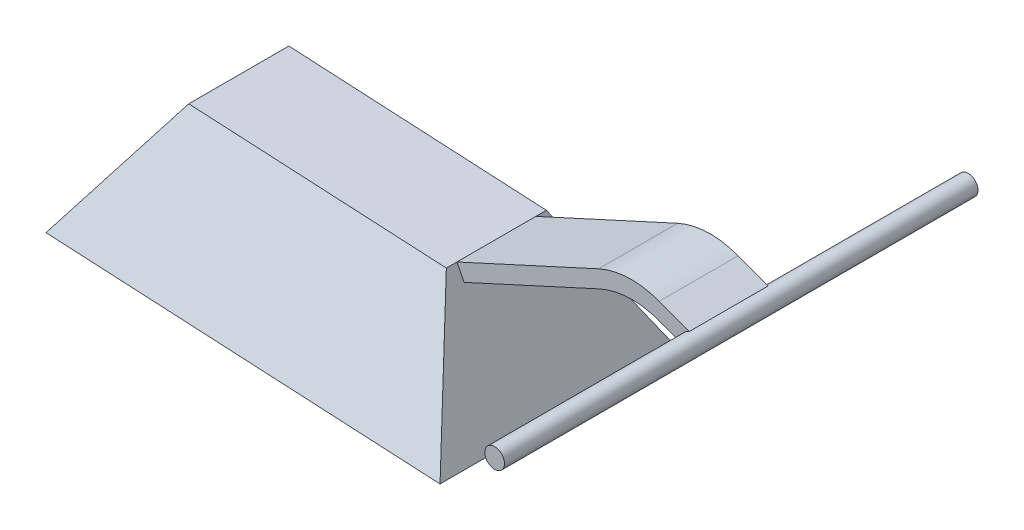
ISO-10303-21;
HEADER;
FILE_DESCRIPTION(('STEP AP214'),'2;1');
FILE_NAME('part.step','',(''),(''),'','','');
FILE_SCHEMA(('AUTOMOTIVE_DESIGN { 1 0 10303 214 1 1 1 1 }'));
ENDSEC;
DATA;
#1=APPLICATION_CONTEXT('core data for automotive mechanical design processes');
#2=APPLICATION_PROTOCOL_DEFINITION('international standard','automotive_design',2000,#1);
#3=PRODUCT_CONTEXT('',#1,'mechanical');
#4=PRODUCT('Part','Part','',(#3));
#5=PRODUCT_RELATED_PRODUCT_CATEGORY('part','',(#4));
#6=PRODUCT_DEFINITION_FORMATION('','',#4);
#7=PRODUCT_DEFINITION_CONTEXT('part definition',#1,'design');
#8=PRODUCT_DEFINITION('design','',#6,#7);
#9=PRODUCT_DEFINITION_SHAPE('','',#8);
#10=(LENGTH_UNIT() NAMED_UNIT(*) SI_UNIT(.MILLI.,.METRE.));
#11=(NAMED_UNIT(*) PLANE_ANGLE_UNIT() SI_UNIT($,.RADIAN.));
#12=(NAMED_UNIT(*) SI_UNIT($,.STERADIAN.) SOLID_ANGLE_UNIT());
#13=UNCERTAINTY_MEASURE_WITH_UNIT(LENGTH_MEASURE(1.E-05),#10,'distance_accuracy_value','');
#14=(GEOMETRIC_REPRESENTATION_CONTEXT(3) GLOBAL_UNCERTAINTY_ASSIGNED_CONTEXT((#13)) GLOBAL_UNIT_ASSIGNED_CONTEXT((#10,
#11,#12)) REPRESENTATION_CONTEXT('',''));
#15=CARTESIAN_POINT('',(0.,0.,0.));
#16=DIRECTION('',(0.,0.,1.));
#17=DIRECTION('',(1.,0.,0.));
#18=AXIS2_PLACEMENT_3D('',#15,#16,#17);
#19=CARTESIAN_POINT('',(47.,22.25,30.));
#20=DIRECTION('',(0.,0.,-1.));
#21=DIRECTION('',(-1.,0.,0.));
#22=AXIS2_PLACEMENT_3D('',#19,#20,#21);
#23=CYLINDRICAL_SURFACE('',#22,1.25);
#24=CARTESIAN_POINT('',(47.,22.25,-30.));
#25=DIRECTION('',(0.,0.,1.));
#26=DIRECTION('',(1.,0.,0.));
#27=AXIS2_PLACEMENT_3D('',#24,#25,#26);
#28=CIRCLE('',#27,1.25);
#29=CARTESIAN_POINT('',(48.25,22.25,-30.));
#30=VERTEX_POINT('',#29);
#31=EDGE_CURVE('E124',#30,#30,#28,.T.);
#32=ORIENTED_EDGE('',*,*,#31,.T.);
#33=EDGE_LOOP('',(#32));
#34=FACE_BOUND('',#33,.T.);
#35=CARTESIAN_POINT('',(47.,22.25,30.));
#36=DIRECTION('',(0.,0.,1.));
#37=DIRECTION('',(1.,0.,0.));
#38=AXIS2_PLACEMENT_3D('',#35,#36,#37);
#39=CIRCLE('',#38,1.25);
#40=CARTESIAN_POINT('',(48.25,22.25,30.));
#41=VERTEX_POINT('',#40);
#42=EDGE_CURVE('E155',#41,#41,#39,.T.);
#43=ORIENTED_EDGE('',*,*,#42,.F.);
#44=EDGE_LOOP('',(#43));
#45=FACE_BOUND('',#44,.T.);
#46=CARTESIAN_POINT('',(47.,22.25,5.));
#47=DIRECTION('',(0.,0.,-1.));
#48=DIRECTION('',(-1.,0.,0.));
#49=AXIS2_PLACEMENT_3D('',#46,#47,#48);
#50=CIRCLE('',#49,1.25);
#51=CARTESIAN_POINT('',(45.9466296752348,21.5770134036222,5.));
#52=VERTEX_POINT('',#51);
#53=CARTESIAN_POINT('',(46.6488765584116,23.4496717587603,5.));
#54=VERTEX_POINT('',#53);
#55=EDGE_CURVE('E169',#52,#54,#50,.T.);
#56=ORIENTED_EDGE('',*,*,#55,.F.);
#57=DIRECTION('',(0.,0.,-1.));
#58=VECTOR('',#57,1.);
#59=CARTESIAN_POINT('',(45.9466296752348,21.5770134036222,30.));
#60=LINE('',#59,#58);
#61=CARTESIAN_POINT('',(45.9466296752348,21.5770134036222,-5.));
#62=VERTEX_POINT('',#61);
#63=EDGE_CURVE('E166',#62,#52,#60,.F.);
#64=ORIENTED_EDGE('',*,*,#63,.F.);
#65=CARTESIAN_POINT('',(47.,22.25,-5.));
#66=DIRECTION('',(0.,0.,-1.));
#67=DIRECTION('',(-1.,0.,0.));
#68=AXIS2_PLACEMENT_3D('',#65,#66,#67);
#69=CIRCLE('',#68,1.25);
#70=CARTESIAN_POINT('',(46.6488765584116,23.4496717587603,-5.));
#71=VERTEX_POINT('',#70);
#72=EDGE_CURVE('E158',#62,#71,#69,.T.);
#73=ORIENTED_EDGE('',*,*,#72,.T.);
#74=DIRECTION('',(0.,0.,-1.));
#75=VECTOR('',#74,1.);
#76=CARTESIAN_POINT('',(46.6488765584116,23.4496717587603,30.));
#77=LINE('',#76,#75);
#78=EDGE_CURVE('E163',#71,#54,#77,.F.);
#79=ORIENTED_EDGE('',*,*,#78,.T.);
#80=EDGE_LOOP('',(#56,#64,#73,#79));
#81=FACE_BOUND('',#80,.T.);
#82=ADVANCED_FACE('F49',(#34,#45,#81),#23,.T.);
#83=CARTESIAN_POINT('',(47.,22.25,30.));
#84=DIRECTION('',(0.,0.,1.));
#85=DIRECTION('',(1.,0.,0.));
#86=AXIS2_PLACEMENT_3D('',#83,#84,#85);
#87=PLANE('',#86);
#88=ORIENTED_EDGE('',*,*,#42,.T.);
#89=EDGE_LOOP('',(#88));
#90=FACE_BOUND('',#89,.T.);
#91=ADVANCED_FACE('F207',(#90),#87,.T.);
#92=CARTESIAN_POINT('',(47.,22.25,-30.));
#93=DIRECTION('',(0.,0.,1.));
#94=DIRECTION('',(1.,0.,0.));
#95=AXIS2_PLACEMENT_3D('',#92,#93,#94);
#96=PLANE('',#95);
#97=ORIENTED_EDGE('',*,*,#31,.F.);
#98=EDGE_LOOP('',(#97));
#99=FACE_BOUND('',#98,.T.);
#100=ADVANCED_FACE('F215',(#99),#96,.F.);
#101=CARTESIAN_POINT('',(38.6488765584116,24.313670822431,5.));
#102=DIRECTION('',(0.351123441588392,0.936329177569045,0.));
#103=DIRECTION('',(-0.936329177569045,0.351123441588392,0.));
#104=AXIS2_PLACEMENT_3D('',#101,#102,#103);
#105=PLANE('',#104);
#106=DIRECTION('',(0.936329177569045,-0.351123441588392,0.));
#107=VECTOR('',#106,1.);
#108=CARTESIAN_POINT('',(38.6488765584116,24.313670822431,5.));
#109=LINE('',#108,#107);
#110=CARTESIAN_POINT('',(42.9331010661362,22.7070866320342,5.));
#111=VERTEX_POINT('',#110);
#112=EDGE_CURVE('E153',#111,#52,#109,.T.);
#113=ORIENTED_EDGE('',*,*,#112,.F.);
#114=DIRECTION('',(0.,0.,-1.));
#115=VECTOR('',#114,1.);
#116=CARTESIAN_POINT('',(42.9331010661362,22.7070866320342,-5.));
#117=LINE('',#116,#115);
#118=CARTESIAN_POINT('',(42.9331010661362,22.7070866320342,-5.));
#119=VERTEX_POINT('',#118);
#120=EDGE_CURVE('E172',#111,#119,#117,.T.);
#121=ORIENTED_EDGE('',*,*,#120,.T.);
#122=DIRECTION('',(0.936329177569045,-0.351123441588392,0.));
#123=VECTOR('',#122,1.);
#124=CARTESIAN_POINT('',(38.6488765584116,24.313670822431,-5.));
#125=LINE('',#124,#123);
#126=EDGE_CURVE('E143',#119,#62,#125,.T.);
#127=ORIENTED_EDGE('',*,*,#126,.T.);
#128=ORIENTED_EDGE('',*,*,#63,.T.);
#129=EDGE_LOOP('',(#113,#121,#127,#128));
#130=FACE_BOUND('',#129,.T.);
#131=ADVANCED_FACE('F194',(#130),#105,.F.);
#132=CARTESIAN_POINT('',(39.3511234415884,26.186329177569,5.));
#133=DIRECTION('',(0.351123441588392,0.936329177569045,0.));
#134=DIRECTION('',(-0.936329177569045,0.351123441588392,0.));
#135=AXIS2_PLACEMENT_3D('',#132,#133,#134);
#136=PLANE('',#135);
#137=DIRECTION('',(0.936329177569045,-0.351123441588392,0.));
#138=VECTOR('',#137,1.);
#139=CARTESIAN_POINT('',(39.3511234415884,26.186329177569,-5.));
#140=LINE('',#139,#138);
#141=CARTESIAN_POINT('',(42.8563980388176,24.8718512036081,-5.));
#142=VERTEX_POINT('',#141);
#143=EDGE_CURVE('E145',#142,#71,#140,.T.);
#144=ORIENTED_EDGE('',*,*,#143,.F.);
#145=DIRECTION('',(0.,0.,-1.));
#146=VECTOR('',#145,1.);
#147=CARTESIAN_POINT('',(42.8563980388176,24.8718512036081,5.));
#148=LINE('',#147,#146);
#149=CARTESIAN_POINT('',(42.8563980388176,24.8718512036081,5.));
#150=VERTEX_POINT('',#149);
#151=EDGE_CURVE('E64',#142,#150,#148,.F.);
#152=ORIENTED_EDGE('',*,*,#151,.T.);
#153=DIRECTION('',(0.936329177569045,-0.351123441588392,0.));
#154=VECTOR('',#153,1.);
#155=CARTESIAN_POINT('',(39.3511234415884,26.186329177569,5.));
#156=LINE('',#155,#154);
#157=EDGE_CURVE('E134',#150,#54,#156,.T.);
#158=ORIENTED_EDGE('',*,*,#157,.T.);
#159=ORIENTED_EDGE('',*,*,#78,.F.);
#160=EDGE_LOOP('',(#144,#152,#158,#159));
#161=FACE_BOUND('',#160,.T.);
#162=ADVANCED_FACE('F199',(#161),#136,.T.);
#163=CARTESIAN_POINT('',(15.6933827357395,15.6721591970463,5.));
#164=DIRECTION('',(-0.416512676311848,0.909129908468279,0.));
#165=DIRECTION('',(-0.909129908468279,-0.416512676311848,0.));
#166=AXIS2_PLACEMENT_3D('',#163,#164,#165);
#167=PLANE('',#166);
#168=DIRECTION('',(0.909129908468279,0.416512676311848,0.));
#169=VECTOR('',#168,1.);
#170=CARTESIAN_POINT('',(15.6933827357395,15.6721591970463,5.));
#171=LINE('',#170,#169);
#172=CARTESIAN_POINT('',(15.6933827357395,15.6721591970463,5.));
#173=VERTEX_POINT('',#172);
#174=CARTESIAN_POINT('',(35.1800368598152,24.5998585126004,5.));
#175=VERTEX_POINT('',#174);
#176=EDGE_CURVE('E117',#173,#175,#171,.T.);
#177=ORIENTED_EDGE('',*,*,#176,.T.);
#178=DIRECTION('',(0.,0.,-1.));
#179=VECTOR('',#178,1.);
#180=CARTESIAN_POINT('',(35.1800368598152,24.5998585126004,5.));
#181=LINE('',#180,#179);
#182=CARTESIAN_POINT('',(35.1800368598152,24.5998585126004,-5.));
#183=VERTEX_POINT('',#182);
#184=EDGE_CURVE('E177',#175,#183,#181,.T.);
#185=ORIENTED_EDGE('',*,*,#184,.T.);
#186=DIRECTION('',(0.909129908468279,0.416512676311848,0.));
#187=VECTOR('',#186,1.);
#188=CARTESIAN_POINT('',(15.6933827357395,15.6721591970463,-5.));
#189=LINE('',#188,#187);
#190=CARTESIAN_POINT('',(15.6933827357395,15.6721591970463,-5.));
#191=VERTEX_POINT('',#190);
#192=EDGE_CURVE('E119',#191,#183,#189,.T.);
#193=ORIENTED_EDGE('',*,*,#192,.F.);
#194=DIRECTION('',(0.,0.,-1.));
#195=VECTOR('',#194,1.);
#196=CARTESIAN_POINT('',(15.6933827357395,15.6721591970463,5.));
#197=LINE('',#196,#195);
#198=EDGE_CURVE('E113',#173,#191,#197,.T.);
#199=ORIENTED_EDGE('',*,*,#198,.F.);
#200=EDGE_LOOP('',(#177,#185,#193,#199));
#201=FACE_BOUND('',#200,.T.);
#202=ADVANCED_FACE('F115',(#201),#167,.T.);
#203=CARTESIAN_POINT('',(16.5264080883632,13.8538993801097,5.));
#204=DIRECTION('',(-0.909129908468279,-0.416512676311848,0.));
#205=DIRECTION('',(0.416512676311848,-0.909129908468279,0.));
#206=AXIS2_PLACEMENT_3D('',#203,#204,#205);
#207=PLANE('',#206);
#208=DIRECTION('',(-0.416512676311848,0.909129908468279,0.));
#209=VECTOR('',#208,1.);
#210=CARTESIAN_POINT('',(16.5264080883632,13.8538993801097,-5.));
#211=LINE('',#210,#209);
#212=CARTESIAN_POINT('',(16.5264080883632,13.8538993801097,-5.));
#213=VERTEX_POINT('',#212);
#214=EDGE_CURVE('E148',#213,#191,#211,.T.);
#215=ORIENTED_EDGE('',*,*,#214,.F.);
#216=DIRECTION('',(0.,0.,-1.));
#217=VECTOR('',#216,1.);
#218=CARTESIAN_POINT('',(16.5264080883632,13.8538993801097,5.));
#219=LINE('',#218,#217);
#220=CARTESIAN_POINT('',(16.5264080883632,13.8538993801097,5.));
#221=VERTEX_POINT('',#220);
#222=EDGE_CURVE('E125',#221,#213,#219,.T.);
#223=ORIENTED_EDGE('',*,*,#222,.F.);
#224=DIRECTION('',(-0.416512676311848,0.909129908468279,0.));
#225=VECTOR('',#224,1.);
#226=CARTESIAN_POINT('',(16.5264080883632,13.8538993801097,5.));
#227=LINE('',#226,#225);
#228=EDGE_CURVE('E131',#221,#173,#227,.T.);
#229=ORIENTED_EDGE('',*,*,#228,.T.);
#230=ORIENTED_EDGE('',*,*,#198,.T.);
#231=EDGE_LOOP('',(#215,#223,#229,#230));
#232=FACE_BOUND('',#231,.T.);
#233=ADVANCED_FACE('F136',(#232),#207,.T.);
#234=CARTESIAN_POINT('',(16.5264080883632,13.8538993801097,5.));
#235=DIRECTION('',(-0.416512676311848,0.909129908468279,0.));
#236=DIRECTION('',(-0.909129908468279,-0.416512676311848,0.));
#237=AXIS2_PLACEMENT_3D('',#234,#235,#236);
#238=PLANE('',#237);
#239=DIRECTION('',(0.909129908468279,0.416512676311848,0.));
#240=VECTOR('',#239,1.);
#241=CARTESIAN_POINT('',(16.5264080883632,13.8538993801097,-5.));
#242=LINE('',#241,#240);
#243=CARTESIAN_POINT('',(35.2567398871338,22.4350939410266,-5.));
#244=VERTEX_POINT('',#243);
#245=EDGE_CURVE('E150',#213,#244,#242,.T.);
#246=ORIENTED_EDGE('',*,*,#245,.T.);
#247=DIRECTION('',(0.,0.,-1.));
#248=VECTOR('',#247,1.);
#249=CARTESIAN_POINT('',(35.2567398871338,22.4350939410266,5.));
#250=LINE('',#249,#248);
#251=CARTESIAN_POINT('',(35.2567398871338,22.4350939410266,5.));
#252=VERTEX_POINT('',#251);
#253=EDGE_CURVE('E175',#244,#252,#250,.F.);
#254=ORIENTED_EDGE('',*,*,#253,.T.);
#255=DIRECTION('',(0.909129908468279,0.416512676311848,0.));
#256=VECTOR('',#255,1.);
#257=CARTESIAN_POINT('',(16.5264080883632,13.8538993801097,5.));
#258=LINE('',#257,#256);
#259=EDGE_CURVE('E138',#221,#252,#258,.T.);
#260=ORIENTED_EDGE('',*,*,#259,.F.);
#261=ORIENTED_EDGE('',*,*,#222,.T.);
#262=EDGE_LOOP('',(#246,#254,#260,#261));
#263=FACE_BOUND('',#262,.T.);
#264=ADVANCED_FACE('F189',(#263),#238,.F.);
#265=CARTESIAN_POINT('',(0.,0.,5.));
#266=DIRECTION('',(0.,0.,-1.));
#267=DIRECTION('',(-1.,0.,0.));
#268=AXIS2_PLACEMENT_3D('',#265,#266,#267);
#269=PLANE('',#268);
#270=ORIENTED_EDGE('',*,*,#157,.F.);
#271=CARTESIAN_POINT('',(39.3451636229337,15.5085594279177,5.));
#272=DIRECTION('',(0.,0.,-1.));
#273=DIRECTION('',(-1.,0.,0.));
#274=AXIS2_PLACEMENT_3D('',#271,#272,#273);
#275=CIRCLE('',#274,10.);
#276=EDGE_CURVE('E133',#150,#175,#275,.F.);
#277=ORIENTED_EDGE('',*,*,#276,.T.);
#278=ORIENTED_EDGE('',*,*,#176,.F.);
#279=ORIENTED_EDGE('',*,*,#228,.F.);
#280=ORIENTED_EDGE('',*,*,#259,.T.);
#281=CARTESIAN_POINT('',(39.4218666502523,13.3437948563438,5.));
#282=DIRECTION('',(0.,0.,-1.));
#283=DIRECTION('',(-1.,0.,0.));
#284=AXIS2_PLACEMENT_3D('',#281,#282,#283);
#285=CIRCLE('',#284,10.);
#286=EDGE_CURVE('E12',#252,#111,#285,.T.);
#287=ORIENTED_EDGE('',*,*,#286,.T.);
#288=ORIENTED_EDGE('',*,*,#112,.T.);
#289=ORIENTED_EDGE('',*,*,#55,.T.);
#290=EDGE_LOOP('',(#270,#277,#278,#279,#280,#287,#288,#289));
#291=FACE_BOUND('',#290,.T.);
#292=ADVANCED_FACE('F129',(#291),#269,.F.);
#293=CARTESIAN_POINT('',(0.,0.,-5.));
#294=DIRECTION('',(0.,0.,-1.));
#295=DIRECTION('',(-1.,0.,0.));
#296=AXIS2_PLACEMENT_3D('',#293,#294,#295);
#297=PLANE('',#296);
#298=ORIENTED_EDGE('',*,*,#192,.T.);
#299=CARTESIAN_POINT('',(39.3451636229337,15.5085594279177,-5.));
#300=DIRECTION('',(0.,0.,-1.));
#301=DIRECTION('',(-1.,0.,0.));
#302=AXIS2_PLACEMENT_3D('',#299,#300,#301);
#303=CIRCLE('',#302,10.);
#304=EDGE_CURVE('E72',#183,#142,#303,.T.);
#305=ORIENTED_EDGE('',*,*,#304,.T.);
#306=ORIENTED_EDGE('',*,*,#143,.T.);
#307=ORIENTED_EDGE('',*,*,#72,.F.);
#308=ORIENTED_EDGE('',*,*,#126,.F.);
#309=CARTESIAN_POINT('',(39.4218666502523,13.3437948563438,-5.));
#310=DIRECTION('',(0.,0.,-1.));
#311=DIRECTION('',(-1.,0.,0.));
#312=AXIS2_PLACEMENT_3D('',#309,#310,#311);
#313=CIRCLE('',#312,10.);
#314=EDGE_CURVE('E57',#119,#244,#313,.F.);
#315=ORIENTED_EDGE('',*,*,#314,.T.);
#316=ORIENTED_EDGE('',*,*,#245,.F.);
#317=ORIENTED_EDGE('',*,*,#214,.T.);
#318=EDGE_LOOP('',(#298,#305,#306,#307,#308,#315,#316,#317));
#319=FACE_BOUND('',#318,.T.);
#320=ADVANCED_FACE('F183',(#319),#297,.T.);
#321=CARTESIAN_POINT('',(39.4218666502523,13.3437948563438,5.));
#322=DIRECTION('',(0.,0.,1.));
#323=DIRECTION('',(1.,0.,0.));
#324=AXIS2_PLACEMENT_3D('',#321,#322,#323);
#325=CYLINDRICAL_SURFACE('',#324,10.);
#326=ORIENTED_EDGE('',*,*,#286,.F.);
#327=ORIENTED_EDGE('',*,*,#253,.F.);
#328=ORIENTED_EDGE('',*,*,#314,.F.);
#329=ORIENTED_EDGE('',*,*,#120,.F.);
#330=EDGE_LOOP('',(#326,#327,#328,#329));
#331=FACE_BOUND('',#330,.T.);
#332=ADVANCED_FACE('F191',(#331),#325,.F.);
#333=CARTESIAN_POINT('',(39.3451636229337,15.5085594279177,5.));
#334=DIRECTION('',(0.,0.,-1.));
#335=DIRECTION('',(-1.,0.,0.));
#336=AXIS2_PLACEMENT_3D('',#333,#334,#335);
#337=CYLINDRICAL_SURFACE('',#336,10.);
#338=ORIENTED_EDGE('',*,*,#276,.F.);
#339=ORIENTED_EDGE('',*,*,#151,.F.);
#340=ORIENTED_EDGE('',*,*,#304,.F.);
#341=ORIENTED_EDGE('',*,*,#184,.F.);
#342=EDGE_LOOP('',(#338,#339,#340,#341));
#343=FACE_BOUND('',#342,.T.);
#344=ADVANCED_FACE('F51',(#343),#337,.T.);
#345=CLOSED_SHELL('',(#82,#91,#100,#131,#162,#202,#233,#264,#292,#320,#332,#344));
#346=MANIFOLD_SOLID_BREP('B2',#345);
#347=CARTESIAN_POINT('',(-24.8479591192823,3.55576086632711,15.));
#348=DIRECTION('',(-0.838670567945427,0.544639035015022,0.));
#349=DIRECTION('',(-0.544639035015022,-0.838670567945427,0.));
#350=AXIS2_PLACEMENT_3D('',#347,#348,#349);
#351=PLANE('',#350);
#352=DIRECTION('',(0.,0.,-1.));
#353=VECTOR('',#352,1.);
#354=CARTESIAN_POINT('',(-24.8479591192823,3.55576086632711,15.));
#355=LINE('',#354,#353);
#356=CARTESIAN_POINT('',(-24.8479591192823,3.55576086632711,15.));
#357=VERTEX_POINT('',#356);
#358=CARTESIAN_POINT('',(-24.8479591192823,3.55576086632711,-15.));
#359=VERTEX_POINT('',#358);
#360=EDGE_CURVE('E357',#357,#359,#355,.T.);
#361=ORIENTED_EDGE('',*,*,#360,.F.);
#362=DIRECTION('',(-0.487139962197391,-0.750129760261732,0.447213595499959));
#363=VECTOR('',#362,1.);
#364=CARTESIAN_POINT('',(-13.9551784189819,20.3291722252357,4.99999999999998));
#365=LINE('',#364,#363);
#366=CARTESIAN_POINT('',(-15.4145343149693,18.0819612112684,6.33974596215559));
#367=VERTEX_POINT('',#366);
#368=EDGE_CURVE('E47',#367,#357,#365,.T.);
#369=ORIENTED_EDGE('',*,*,#368,.F.);
#370=DIRECTION('',(0.,0.,-1.));
#371=VECTOR('',#370,1.);
#372=CARTESIAN_POINT('',(-15.4145343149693,18.0819612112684,15.));
#373=LINE('',#372,#371);
#374=CARTESIAN_POINT('',(-15.4145343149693,18.0819612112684,-6.33974596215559));
#375=VERTEX_POINT('',#374);
#376=EDGE_CURVE('E359',#367,#375,#373,.T.);
#377=ORIENTED_EDGE('',*,*,#376,.T.);
#378=DIRECTION('',(-0.487139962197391,-0.750129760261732,-0.447213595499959));
#379=VECTOR('',#378,1.);
#380=CARTESIAN_POINT('',(-18.312290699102,13.6198076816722,-8.99999999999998));
#381=LINE('',#380,#379);
#382=EDGE_CURVE('E344',#375,#359,#381,.T.);
#383=ORIENTED_EDGE('',*,*,#382,.T.);
#384=EDGE_LOOP('',(#361,#369,#377,#383));
#385=FACE_BOUND('',#384,.T.);
#386=ADVANCED_FACE('F307',(#385),#351,.T.);
#387=CARTESIAN_POINT('',(25.0835176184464,0.938963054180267,15.));
#388=DIRECTION('',(0.0261679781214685,0.499314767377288,0.866025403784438));
#389=DIRECTION('',(0.,-0.866322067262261,0.499485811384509));
#390=AXIS2_PLACEMENT_3D('',#387,#388,#389);
#391=PLANE('',#390);
#392=DIRECTION('',(-0.998629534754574,0.0523359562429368,0.));
#393=VECTOR('',#392,1.);
#394=CARTESIAN_POINT('',(25.0835176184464,0.938963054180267,15.));
#395=LINE('',#394,#393);
#396=CARTESIAN_POINT('',(25.0835176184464,0.938963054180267,15.));
#397=VERTEX_POINT('',#396);
#398=EDGE_CURVE('E369',#397,#357,#395,.T.);
#399=ORIENTED_EDGE('',*,*,#398,.F.);
#400=DIRECTION('',(0.406061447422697,-0.796940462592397,0.447213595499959));
#401=VECTOR('',#400,1.);
#402=CARTESIAN_POINT('',(25.0835176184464,0.938963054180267,15.));
#403=LINE('',#402,#401);
#404=CARTESIAN_POINT('',(17.2201715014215,16.3716487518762,6.3397459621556));
#405=VERTEX_POINT('',#404);
#406=EDGE_CURVE('E317',#405,#397,#403,.T.);
#407=ORIENTED_EDGE('',*,*,#406,.F.);
#408=DIRECTION('',(-0.998629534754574,0.0523359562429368,0.));
#409=VECTOR('',#408,1.);
#410=CARTESIAN_POINT('',(25.8685569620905,15.9184060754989,6.33974596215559));
#411=LINE('',#410,#409);
#412=EDGE_CURVE('E360',#405,#367,#411,.T.);
#413=ORIENTED_EDGE('',*,*,#412,.T.);
#414=ORIENTED_EDGE('',*,*,#368,.T.);
#415=EDGE_LOOP('',(#399,#407,#413,#414));
#416=FACE_BOUND('',#415,.T.);
#417=ADVANCED_FACE('F309',(#416),#391,.T.);
#418=CARTESIAN_POINT('',(25.0835176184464,0.938963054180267,15.));
#419=DIRECTION('',(0.891006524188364,0.453990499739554,0.));
#420=DIRECTION('',(-0.453990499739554,0.891006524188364,0.));
#421=AXIS2_PLACEMENT_3D('',#418,#419,#420);
#422=PLANE('',#421);
#423=DIRECTION('',(0.,0.,1.));
#424=VECTOR('',#423,1.);
#425=CARTESIAN_POINT('',(25.0835176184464,0.938963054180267,15.));
#426=LINE('',#425,#424);
#427=CARTESIAN_POINT('',(25.0835176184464,0.938963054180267,-15.));
#428=VERTEX_POINT('',#427);
#429=EDGE_CURVE('E366',#428,#397,#426,.T.);
#430=ORIENTED_EDGE('',*,*,#429,.F.);
#431=DIRECTION('',(0.406061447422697,-0.796940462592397,-0.447213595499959));
#432=VECTOR('',#431,1.);
#433=CARTESIAN_POINT('',(25.0835176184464,0.938963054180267,-15.));
#434=LINE('',#433,#432);
#435=CARTESIAN_POINT('',(17.2201715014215,16.3716487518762,-6.33974596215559));
#436=VERTEX_POINT('',#435);
#437=EDGE_CURVE('E337',#436,#428,#434,.T.);
#438=ORIENTED_EDGE('',*,*,#437,.F.);
#439=DIRECTION('',(0.,0.,1.));
#440=VECTOR('',#439,1.);
#441=CARTESIAN_POINT('',(17.2201715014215,16.3716487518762,15.));
#442=LINE('',#441,#440);
#443=EDGE_CURVE('E377',#436,#405,#442,.T.);
#444=ORIENTED_EDGE('',*,*,#443,.T.);
#445=ORIENTED_EDGE('',*,*,#406,.T.);
#446=EDGE_LOOP('',(#430,#438,#444,#445));
#447=FACE_BOUND('',#446,.T.);
#448=ADVANCED_FACE('F382',(#447),#422,.T.);
#449=CARTESIAN_POINT('',(25.0835176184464,0.938963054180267,-15.));
#450=DIRECTION('',(0.0261679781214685,0.499314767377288,-0.866025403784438));
#451=DIRECTION('',(0.,0.866322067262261,0.499485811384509));
#452=AXIS2_PLACEMENT_3D('',#449,#450,#451);
#453=PLANE('',#452);
#454=DIRECTION('',(0.998629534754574,-0.0523359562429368,0.));
#455=VECTOR('',#454,1.);
#456=CARTESIAN_POINT('',(25.0835176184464,0.938963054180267,-15.));
#457=LINE('',#456,#455);
#458=EDGE_CURVE('E363',#359,#428,#457,.T.);
#459=ORIENTED_EDGE('',*,*,#458,.F.);
#460=ORIENTED_EDGE('',*,*,#382,.F.);
#461=DIRECTION('',(0.998629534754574,-0.0523359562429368,0.));
#462=VECTOR('',#461,1.);
#463=CARTESIAN_POINT('',(25.8685569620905,15.9184060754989,-6.33974596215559));
#464=LINE('',#463,#462);
#465=EDGE_CURVE('E311',#375,#436,#464,.T.);
#466=ORIENTED_EDGE('',*,*,#465,.T.);
#467=ORIENTED_EDGE('',*,*,#437,.T.);
#468=EDGE_LOOP('',(#459,#460,#466,#467));
#469=FACE_BOUND('',#468,.T.);
#470=ADVANCED_FACE('F364',(#469),#453,.T.);
#471=CARTESIAN_POINT('',(0.902818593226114,17.2268049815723,0.));
#472=DIRECTION('',(0.0523359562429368,0.998629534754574,0.));
#473=DIRECTION('',(-0.998629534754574,0.0523359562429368,0.));
#474=AXIS2_PLACEMENT_3D('',#471,#472,#473);
#475=PLANE('',#474);
#476=ORIENTED_EDGE('',*,*,#376,.F.);
#477=ORIENTED_EDGE('',*,*,#412,.F.);
#478=ORIENTED_EDGE('',*,*,#443,.F.);
#479=ORIENTED_EDGE('',*,*,#465,.F.);
#480=EDGE_LOOP('',(#476,#477,#478,#479));
#481=FACE_BOUND('',#480,.T.);
#482=ADVANCED_FACE('F380',(#481),#475,.T.);
#483=CARTESIAN_POINT('',(0.117779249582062,2.24736196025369,0.));
#484=DIRECTION('',(0.0523359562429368,0.998629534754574,0.));
#485=DIRECTION('',(-0.998629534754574,0.0523359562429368,0.));
#486=AXIS2_PLACEMENT_3D('',#483,#484,#485);
#487=PLANE('',#486);
#488=ORIENTED_EDGE('',*,*,#360,.T.);
#489=ORIENTED_EDGE('',*,*,#458,.T.);
#490=ORIENTED_EDGE('',*,*,#429,.T.);
#491=ORIENTED_EDGE('',*,*,#398,.T.);
#492=EDGE_LOOP('',(#488,#489,#490,#491));
#493=FACE_BOUND('',#492,.T.);
#494=ADVANCED_FACE('F368',(#493),#487,.F.);
#495=CLOSED_SHELL('',(#386,#417,#448,#470,#482,#494));
#496=MANIFOLD_SOLID_BREP('B6',#495);
#497=ADVANCED_BREP_SHAPE_REPRESENTATION('',(#18,#346,#496),#14);
#498=SHAPE_DEFINITION_REPRESENTATION(#9,#497);
ENDSEC;
END-ISO-10303-21;
